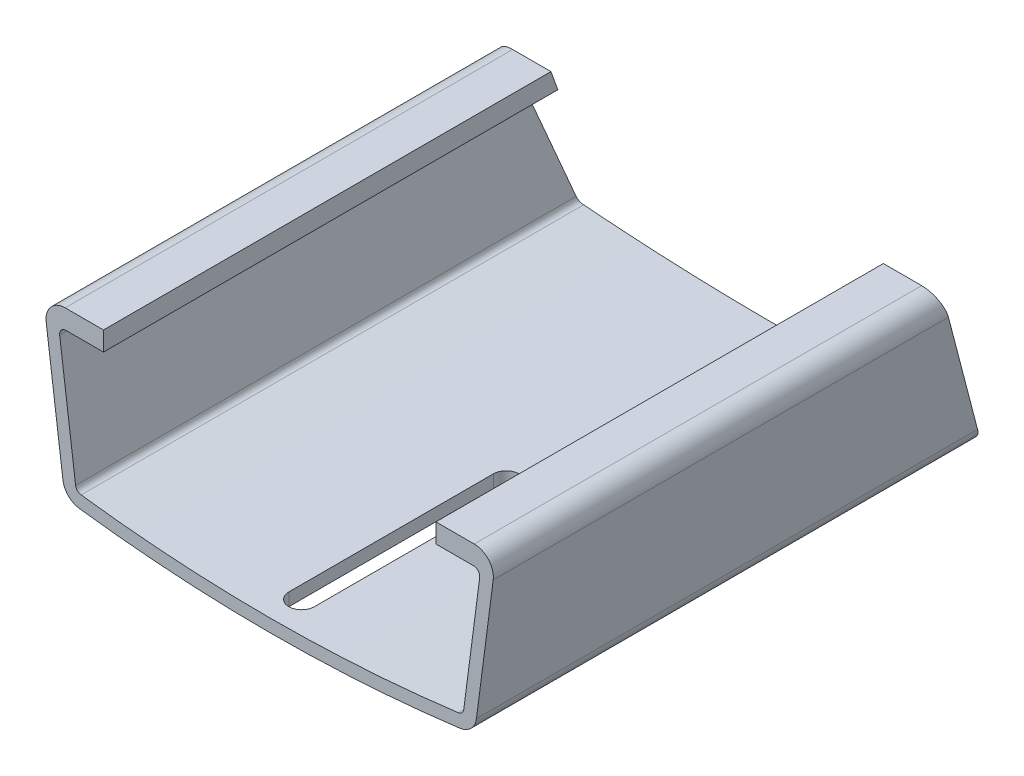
from build123d import *

# Parameters (mm, degrees)
BASE_EXTRUSION_DEPTH         = 80
CONG_1_R                     = 3
ENL_V_MAT_EXTRU_1_DEPTH      = 92.697367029
ENL_V_MAT_EXTRU_2_DEPTH      = 92.106570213
ENL_V_MAT_EXTRU_2_DEPTH_BACK = 92.106570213


with BuildPart() as part:
    # Esquisse1 → Base-Extrusion (new body)
    with BuildSketch(Plane.XY):
        with BuildLine():
            Line((30.360297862, 2.762283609), (32.852694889, 21.870660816))
            ThreePointArc((32.852694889, 21.870660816), (32.612539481, 22.659795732), (31.861094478, 23))
            Line((31.861094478, 23), (26, 23))
            Line((26, 23), (26, 26))
            Line((26, 26), (35.408245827, 26))
            Line((35.408245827, 26), (32.343498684, 2.503605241))
            ThreePointArc((32.343498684, 2.503605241), (31.488891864, 0.769177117), (29.75355776, -0.083588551))
            ThreePointArc((29.75355776, -0.083588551), (0, -2), (-29.75355776, -0.083588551))
            ThreePointArc((-29.75355776, -0.083588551), (-31.488891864, 0.769177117), (-32.343498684, 2.503605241))
            Line((-32.343498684, 2.503605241), (-35.408245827, 26))
            Line((-35.408245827, 26), (-26, 26))
            Line((-26, 26), (-26, 23))
            Line((-26, 23), (-31.861094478, 23))
            ThreePointArc((-31.861094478, 23), (-32.612539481, 22.659795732), (-32.852694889, 21.870660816))
            Line((-32.852694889, 21.870660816), (-30.360297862, 2.762283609))
            ThreePointArc((-30.360297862, 2.762283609), (-30.075428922, 2.184140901), (-29.496984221, 1.899885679))
            ThreePointArc((-29.496984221, 1.899885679), (0, 0), (29.496984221, 1.899885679))
            ThreePointArc((29.496984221, 1.899885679), (30.075428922, 2.184140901), (30.360297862, 2.762283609))
        make_face()
    extrude(amount=BASE_EXTRUSION_DEPTH)

    # Cong_1
    cong_1_edges = [part.edges().sort_by_distance(p)[0] for p in [
        (35.408245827, 26, 40),
        (-35.408245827, 26, 40),
    ]]
    fillet(cong_1_edges, radius=CONG_1_R)

    # Esquisse2 → Enl_v. mat.-Extru.1 (cut, through all)
    with BuildSketch(Plane(origin=(0, 26, 0), x_dir=(-1, 0, 0), z_dir=(0, 1, 0))):
        with BuildLine():
            Line((2, 75), (2, 43))
            ThreePointArc((2, 43), (0, 41), (-2, 43))
            Line((-2, 43), (-2, 75))
            ThreePointArc((-2, 75), (0, 77), (2, 75))
        make_face()
    extrude(amount=-ENL_V_MAT_EXTRU_1_DEPTH, mode=Mode.SUBTRACT)

    # Esquisse3 → Enl_v. mat.-Extru.2 (cut, two sides: drawn at the far end of the back side and taken through both)
    with BuildSketch(Plane(origin=(0, 0, 0), x_dir=(0, 0, -1), z_dir=(1, 0, 0)).offset(-ENL_V_MAT_EXTRU_2_DEPTH_BACK)):
        Polygon((0, 26), (-10, 26), (0, -2), align=None)
    extrude(amount=ENL_V_MAT_EXTRU_2_DEPTH + ENL_V_MAT_EXTRU_2_DEPTH_BACK, mode=Mode.SUBTRACT)


solid = part.part
